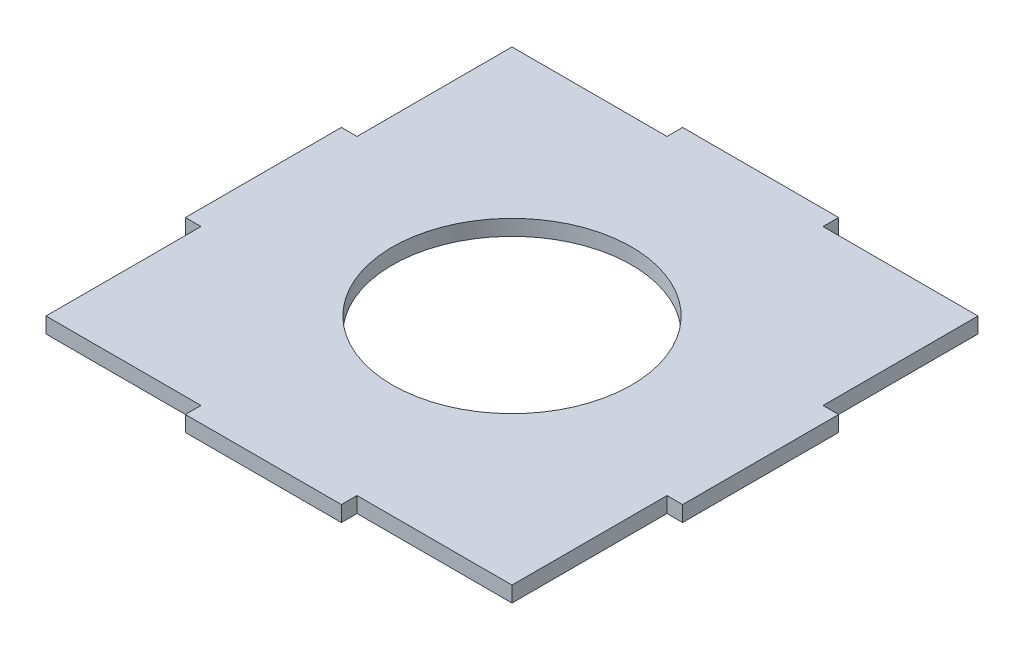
ISO-10303-21;
HEADER;
FILE_DESCRIPTION(('STEP AP214'),'2;1');
FILE_NAME('part.step','',(''),(''),'','','');
FILE_SCHEMA(('AUTOMOTIVE_DESIGN { 1 0 10303 214 1 1 1 1 }'));
ENDSEC;
DATA;
#1=APPLICATION_CONTEXT('core data for automotive mechanical design processes');
#2=APPLICATION_PROTOCOL_DEFINITION('international standard','automotive_design',2000,#1);
#3=PRODUCT_CONTEXT('',#1,'mechanical');
#4=PRODUCT('Part','Part','',(#3));
#5=PRODUCT_RELATED_PRODUCT_CATEGORY('part','',(#4));
#6=PRODUCT_DEFINITION_FORMATION('','',#4);
#7=PRODUCT_DEFINITION_CONTEXT('part definition',#1,'design');
#8=PRODUCT_DEFINITION('design','',#6,#7);
#9=PRODUCT_DEFINITION_SHAPE('','',#8);
#10=(LENGTH_UNIT() NAMED_UNIT(*) SI_UNIT(.MILLI.,.METRE.));
#11=(NAMED_UNIT(*) PLANE_ANGLE_UNIT() SI_UNIT($,.RADIAN.));
#12=(NAMED_UNIT(*) SI_UNIT($,.STERADIAN.) SOLID_ANGLE_UNIT());
#13=UNCERTAINTY_MEASURE_WITH_UNIT(LENGTH_MEASURE(1.E-05),#10,'distance_accuracy_value','');
#14=(GEOMETRIC_REPRESENTATION_CONTEXT(3) GLOBAL_UNCERTAINTY_ASSIGNED_CONTEXT((#13)) GLOBAL_UNIT_ASSIGNED_CONTEXT((#10,
#11,#12)) REPRESENTATION_CONTEXT('',''));
#15=CARTESIAN_POINT('',(0.,0.,0.));
#16=DIRECTION('',(0.,0.,1.));
#17=DIRECTION('',(1.,0.,0.));
#18=AXIS2_PLACEMENT_3D('',#15,#16,#17);
#19=CARTESIAN_POINT('',(-44.8,3.,44.8));
#20=DIRECTION('',(0.,0.,-1.));
#21=DIRECTION('',(-1.,0.,0.));
#22=AXIS2_PLACEMENT_3D('',#19,#20,#21);
#23=PLANE('',#22);
#24=DIRECTION('',(0.,1.,0.));
#25=VECTOR('',#24,1.);
#26=CARTESIAN_POINT('',(14.9999999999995,0.,44.8000000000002));
#27=LINE('',#26,#25);
#28=CARTESIAN_POINT('',(14.9999999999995,0.,44.8000000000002));
#29=VERTEX_POINT('',#28);
#30=CARTESIAN_POINT('',(14.9999999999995,3.,44.8000000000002));
#31=VERTEX_POINT('',#30);
#32=EDGE_CURVE('E244',#29,#31,#27,.T.);
#33=ORIENTED_EDGE('',*,*,#32,.F.);
#34=DIRECTION('',(1.,0.,0.));
#35=VECTOR('',#34,1.);
#36=CARTESIAN_POINT('',(-44.8,0.,44.8));
#37=LINE('',#36,#35);
#38=CARTESIAN_POINT('',(44.8,0.,44.8));
#39=VERTEX_POINT('',#38);
#40=EDGE_CURVE('E194',#29,#39,#37,.T.);
#41=ORIENTED_EDGE('',*,*,#40,.T.);
#42=DIRECTION('',(0.,-1.,0.));
#43=VECTOR('',#42,1.);
#44=CARTESIAN_POINT('',(44.8,3.,44.8));
#45=LINE('',#44,#43);
#46=CARTESIAN_POINT('',(44.8,3.,44.8));
#47=VERTEX_POINT('',#46);
#48=EDGE_CURVE('E41',#47,#39,#45,.T.);
#49=ORIENTED_EDGE('',*,*,#48,.F.);
#50=DIRECTION('',(1.,0.,0.));
#51=VECTOR('',#50,1.);
#52=CARTESIAN_POINT('',(-44.8,3.,44.8));
#53=LINE('',#52,#51);
#54=EDGE_CURVE('E310',#31,#47,#53,.T.);
#55=ORIENTED_EDGE('',*,*,#54,.F.);
#56=EDGE_LOOP('',(#33,#41,#49,#55));
#57=FACE_BOUND('',#56,.T.);
#58=ADVANCED_FACE('F33',(#57),#23,.F.);
#59=CARTESIAN_POINT('',(44.8,3.,-44.8));
#60=DIRECTION('',(-1.,0.,0.));
#61=DIRECTION('',(0.,0.,1.));
#62=AXIS2_PLACEMENT_3D('',#59,#60,#61);
#63=PLANE('',#62);
#64=DIRECTION('',(0.,1.,0.));
#65=VECTOR('',#64,1.);
#66=CARTESIAN_POINT('',(44.8,0.,-15.));
#67=LINE('',#66,#65);
#68=CARTESIAN_POINT('',(44.8,0.,-15.));
#69=VERTEX_POINT('',#68);
#70=CARTESIAN_POINT('',(44.8,3.,-15.));
#71=VERTEX_POINT('',#70);
#72=EDGE_CURVE('E247',#69,#71,#67,.T.);
#73=ORIENTED_EDGE('',*,*,#72,.F.);
#74=DIRECTION('',(0.,0.,-1.));
#75=VECTOR('',#74,1.);
#76=CARTESIAN_POINT('',(44.8,0.,-44.8));
#77=LINE('',#76,#75);
#78=CARTESIAN_POINT('',(44.8,0.,-44.8));
#79=VERTEX_POINT('',#78);
#80=EDGE_CURVE('E193',#69,#79,#77,.T.);
#81=ORIENTED_EDGE('',*,*,#80,.T.);
#82=DIRECTION('',(0.,-1.,0.));
#83=VECTOR('',#82,1.);
#84=CARTESIAN_POINT('',(44.8,3.,-44.8));
#85=LINE('',#84,#83);
#86=CARTESIAN_POINT('',(44.8,3.,-44.8));
#87=VERTEX_POINT('',#86);
#88=EDGE_CURVE('E211',#87,#79,#85,.T.);
#89=ORIENTED_EDGE('',*,*,#88,.F.);
#90=DIRECTION('',(0.,0.,-1.));
#91=VECTOR('',#90,1.);
#92=CARTESIAN_POINT('',(44.8,3.,-44.8));
#93=LINE('',#92,#91);
#94=EDGE_CURVE('E313',#71,#87,#93,.T.);
#95=ORIENTED_EDGE('',*,*,#94,.F.);
#96=EDGE_LOOP('',(#73,#81,#89,#95));
#97=FACE_BOUND('',#96,.T.);
#98=ADVANCED_FACE('F367',(#97),#63,.F.);
#99=CARTESIAN_POINT('',(-44.8,3.,-44.8));
#100=DIRECTION('',(0.,0.,1.));
#101=DIRECTION('',(1.,0.,0.));
#102=AXIS2_PLACEMENT_3D('',#99,#100,#101);
#103=PLANE('',#102);
#104=DIRECTION('',(0.,1.,0.));
#105=VECTOR('',#104,1.);
#106=CARTESIAN_POINT('',(-14.9999999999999,0.,-44.8000000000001));
#107=LINE('',#106,#105);
#108=CARTESIAN_POINT('',(-14.9999999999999,0.,-44.8000000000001));
#109=VERTEX_POINT('',#108);
#110=CARTESIAN_POINT('',(-14.9999999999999,3.,-44.8000000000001));
#111=VERTEX_POINT('',#110);
#112=EDGE_CURVE('E272',#109,#111,#107,.T.);
#113=ORIENTED_EDGE('',*,*,#112,.F.);
#114=DIRECTION('',(-1.,0.,0.));
#115=VECTOR('',#114,1.);
#116=CARTESIAN_POINT('',(-44.8,0.,-44.8));
#117=LINE('',#116,#115);
#118=CARTESIAN_POINT('',(-44.8,0.,-44.8));
#119=VERTEX_POINT('',#118);
#120=EDGE_CURVE('E203',#109,#119,#117,.T.);
#121=ORIENTED_EDGE('',*,*,#120,.T.);
#122=DIRECTION('',(0.,-1.,0.));
#123=VECTOR('',#122,1.);
#124=CARTESIAN_POINT('',(-44.8,3.,-44.8));
#125=LINE('',#124,#123);
#126=CARTESIAN_POINT('',(-44.8,3.,-44.8));
#127=VERTEX_POINT('',#126);
#128=EDGE_CURVE('E208',#127,#119,#125,.T.);
#129=ORIENTED_EDGE('',*,*,#128,.F.);
#130=DIRECTION('',(-1.,0.,0.));
#131=VECTOR('',#130,1.);
#132=CARTESIAN_POINT('',(-44.8,3.,-44.8));
#133=LINE('',#132,#131);
#134=EDGE_CURVE('E314',#111,#127,#133,.T.);
#135=ORIENTED_EDGE('',*,*,#134,.F.);
#136=EDGE_LOOP('',(#113,#121,#129,#135));
#137=FACE_BOUND('',#136,.T.);
#138=ADVANCED_FACE('F325',(#137),#103,.F.);
#139=CARTESIAN_POINT('',(-44.8,3.,-44.8));
#140=DIRECTION('',(1.,0.,0.));
#141=DIRECTION('',(0.,0.,-1.));
#142=AXIS2_PLACEMENT_3D('',#139,#140,#141);
#143=PLANE('',#142);
#144=DIRECTION('',(0.,1.,0.));
#145=VECTOR('',#144,1.);
#146=CARTESIAN_POINT('',(-44.8,0.,15.));
#147=LINE('',#146,#145);
#148=CARTESIAN_POINT('',(-44.8,0.,15.));
#149=VERTEX_POINT('',#148);
#150=CARTESIAN_POINT('',(-44.8,3.,15.));
#151=VERTEX_POINT('',#150);
#152=EDGE_CURVE('E298',#149,#151,#147,.T.);
#153=ORIENTED_EDGE('',*,*,#152,.F.);
#154=DIRECTION('',(0.,0.,1.));
#155=VECTOR('',#154,1.);
#156=CARTESIAN_POINT('',(-44.8,0.,-44.8));
#157=LINE('',#156,#155);
#158=CARTESIAN_POINT('',(-44.8,0.,44.8));
#159=VERTEX_POINT('',#158);
#160=EDGE_CURVE('E300',#149,#159,#157,.T.);
#161=ORIENTED_EDGE('',*,*,#160,.T.);
#162=DIRECTION('',(0.,-1.,0.));
#163=VECTOR('',#162,1.);
#164=CARTESIAN_POINT('',(-44.8,3.,44.8));
#165=LINE('',#164,#163);
#166=CARTESIAN_POINT('',(-44.8,3.,44.8));
#167=VERTEX_POINT('',#166);
#168=EDGE_CURVE('E11',#167,#159,#165,.T.);
#169=ORIENTED_EDGE('',*,*,#168,.F.);
#170=DIRECTION('',(0.,0.,1.));
#171=VECTOR('',#170,1.);
#172=CARTESIAN_POINT('',(-44.8,3.,-44.8));
#173=LINE('',#172,#171);
#174=EDGE_CURVE('E207',#151,#167,#173,.T.);
#175=ORIENTED_EDGE('',*,*,#174,.F.);
#176=EDGE_LOOP('',(#153,#161,#169,#175));
#177=FACE_BOUND('',#176,.T.);
#178=ADVANCED_FACE('F343',(#177),#143,.F.);
#179=CARTESIAN_POINT('',(-44.8,0.,-15.));
#180=VERTEX_POINT('',#179);
#181=EDGE_CURVE('E198',#119,#180,#157,.T.);
#182=ORIENTED_EDGE('',*,*,#181,.T.);
#183=DIRECTION('',(0.,1.,0.));
#184=VECTOR('',#183,1.);
#185=CARTESIAN_POINT('',(-44.8,0.,-15.));
#186=LINE('',#185,#184);
#187=CARTESIAN_POINT('',(-44.8,3.,-15.));
#188=VERTEX_POINT('',#187);
#189=EDGE_CURVE('E290',#180,#188,#186,.T.);
#190=ORIENTED_EDGE('',*,*,#189,.T.);
#191=EDGE_CURVE('E307',#127,#188,#173,.T.);
#192=ORIENTED_EDGE('',*,*,#191,.F.);
#193=ORIENTED_EDGE('',*,*,#128,.T.);
#194=EDGE_LOOP('',(#182,#190,#192,#193));
#195=FACE_BOUND('',#194,.T.);
#196=ADVANCED_FACE('F35',(#195),#143,.F.);
#197=CARTESIAN_POINT('',(-15.0000000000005,0.,44.7999999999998));
#198=VERTEX_POINT('',#197);
#199=EDGE_CURVE('E185',#159,#198,#37,.T.);
#200=ORIENTED_EDGE('',*,*,#199,.T.);
#201=DIRECTION('',(0.,1.,0.));
#202=VECTOR('',#201,1.);
#203=CARTESIAN_POINT('',(-15.0000000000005,0.,44.7999999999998));
#204=LINE('',#203,#202);
#205=CARTESIAN_POINT('',(-15.0000000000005,3.,44.8));
#206=VERTEX_POINT('',#205);
#207=EDGE_CURVE('E168',#198,#206,#204,.T.);
#208=ORIENTED_EDGE('',*,*,#207,.T.);
#209=EDGE_CURVE('E311',#167,#206,#53,.T.);
#210=ORIENTED_EDGE('',*,*,#209,.F.);
#211=ORIENTED_EDGE('',*,*,#168,.T.);
#212=EDGE_LOOP('',(#200,#208,#210,#211));
#213=FACE_BOUND('',#212,.T.);
#214=ADVANCED_FACE('F191',(#213),#23,.F.);
#215=CARTESIAN_POINT('',(44.8,0.,15.));
#216=VERTEX_POINT('',#215);
#217=EDGE_CURVE('E196',#39,#216,#77,.T.);
#218=ORIENTED_EDGE('',*,*,#217,.T.);
#219=DIRECTION('',(0.,1.,0.));
#220=VECTOR('',#219,1.);
#221=CARTESIAN_POINT('',(44.8,0.,15.));
#222=LINE('',#221,#220);
#223=CARTESIAN_POINT('',(44.8,3.,15.));
#224=VERTEX_POINT('',#223);
#225=EDGE_CURVE('E242',#216,#224,#222,.T.);
#226=ORIENTED_EDGE('',*,*,#225,.T.);
#227=EDGE_CURVE('E221',#47,#224,#93,.T.);
#228=ORIENTED_EDGE('',*,*,#227,.F.);
#229=ORIENTED_EDGE('',*,*,#48,.T.);
#230=EDGE_LOOP('',(#218,#226,#228,#229));
#231=FACE_BOUND('',#230,.T.);
#232=ADVANCED_FACE('F219',(#231),#63,.F.);
#233=CARTESIAN_POINT('',(15.0000000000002,0.,-44.7999999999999));
#234=VERTEX_POINT('',#233);
#235=EDGE_CURVE('E204',#79,#234,#117,.T.);
#236=ORIENTED_EDGE('',*,*,#235,.T.);
#237=DIRECTION('',(0.,1.,0.));
#238=VECTOR('',#237,1.);
#239=CARTESIAN_POINT('',(15.0000000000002,0.,-44.7999999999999));
#240=LINE('',#239,#238);
#241=CARTESIAN_POINT('',(15.0000000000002,3.,-44.8));
#242=VERTEX_POINT('',#241);
#243=EDGE_CURVE('E264',#234,#242,#240,.T.);
#244=ORIENTED_EDGE('',*,*,#243,.T.);
#245=EDGE_CURVE('E212',#87,#242,#133,.T.);
#246=ORIENTED_EDGE('',*,*,#245,.F.);
#247=ORIENTED_EDGE('',*,*,#88,.T.);
#248=EDGE_LOOP('',(#236,#244,#246,#247));
#249=FACE_BOUND('',#248,.T.);
#250=ADVANCED_FACE('F378',(#249),#103,.F.);
#251=CARTESIAN_POINT('',(0.,3.,0.));
#252=DIRECTION('',(0.,1.,0.));
#253=DIRECTION('',(0.,0.,1.));
#254=AXIS2_PLACEMENT_3D('',#251,#252,#253);
#255=PLANE('',#254);
#256=CARTESIAN_POINT('',(0.,3.,0.));
#257=DIRECTION('',(0.,1.,0.));
#258=DIRECTION('',(0.,0.,1.));
#259=AXIS2_PLACEMENT_3D('',#256,#257,#258);
#260=CIRCLE('',#259,23.);
#261=CARTESIAN_POINT('',(0.,3.,23.));
#262=VERTEX_POINT('',#261);
#263=EDGE_CURVE('E353',#262,#262,#260,.T.);
#264=ORIENTED_EDGE('',*,*,#263,.F.);
#265=EDGE_LOOP('',(#264));
#266=FACE_BOUND('',#265,.T.);
#267=ORIENTED_EDGE('',*,*,#191,.T.);
#268=DIRECTION('',(-1.,0.,0.));
#269=VECTOR('',#268,1.);
#270=CARTESIAN_POINT('',(-44.8,3.,-15.));
#271=LINE('',#270,#269);
#272=CARTESIAN_POINT('',(-47.8,3.,-15.));
#273=VERTEX_POINT('',#272);
#274=EDGE_CURVE('E274',#188,#273,#271,.T.);
#275=ORIENTED_EDGE('',*,*,#274,.T.);
#276=DIRECTION('',(0.,0.,1.));
#277=VECTOR('',#276,1.);
#278=CARTESIAN_POINT('',(-47.8,3.,-15.));
#279=LINE('',#278,#277);
#280=CARTESIAN_POINT('',(-47.8,3.,15.));
#281=VERTEX_POINT('',#280);
#282=EDGE_CURVE('E293',#273,#281,#279,.T.);
#283=ORIENTED_EDGE('',*,*,#282,.T.);
#284=DIRECTION('',(1.,0.,0.));
#285=VECTOR('',#284,1.);
#286=CARTESIAN_POINT('',(-44.8,3.,15.));
#287=LINE('',#286,#285);
#288=EDGE_CURVE('E285',#281,#151,#287,.T.);
#289=ORIENTED_EDGE('',*,*,#288,.T.);
#290=ORIENTED_EDGE('',*,*,#174,.T.);
#291=ORIENTED_EDGE('',*,*,#209,.T.);
#292=DIRECTION('',(0.,0.,1.));
#293=VECTOR('',#292,1.);
#294=CARTESIAN_POINT('',(-15.0000000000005,3.,44.7999999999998));
#295=LINE('',#294,#293);
#296=CARTESIAN_POINT('',(-15.0000000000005,3.,47.7999999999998));
#297=VERTEX_POINT('',#296);
#298=EDGE_CURVE('E48',#206,#297,#295,.T.);
#299=ORIENTED_EDGE('',*,*,#298,.T.);
#300=DIRECTION('',(1.,0.,0.));
#301=VECTOR('',#300,1.);
#302=CARTESIAN_POINT('',(-15.0000000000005,3.,47.7999999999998));
#303=LINE('',#302,#301);
#304=CARTESIAN_POINT('',(14.9999999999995,3.,47.8000000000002));
#305=VERTEX_POINT('',#304);
#306=EDGE_CURVE('E347',#297,#305,#303,.T.);
#307=ORIENTED_EDGE('',*,*,#306,.T.);
#308=DIRECTION('',(0.,0.,-1.));
#309=VECTOR('',#308,1.);
#310=CARTESIAN_POINT('',(14.9999999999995,3.,44.8000000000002));
#311=LINE('',#310,#309);
#312=EDGE_CURVE('E189',#305,#31,#311,.T.);
#313=ORIENTED_EDGE('',*,*,#312,.T.);
#314=ORIENTED_EDGE('',*,*,#54,.T.);
#315=ORIENTED_EDGE('',*,*,#227,.T.);
#316=DIRECTION('',(1.,0.,0.));
#317=VECTOR('',#316,1.);
#318=CARTESIAN_POINT('',(44.8,3.,15.));
#319=LINE('',#318,#317);
#320=CARTESIAN_POINT('',(47.8,3.,15.));
#321=VERTEX_POINT('',#320);
#322=EDGE_CURVE('E56',#224,#321,#319,.T.);
#323=ORIENTED_EDGE('',*,*,#322,.T.);
#324=DIRECTION('',(0.,0.,-1.));
#325=VECTOR('',#324,1.);
#326=CARTESIAN_POINT('',(47.8,3.,15.));
#327=LINE('',#326,#325);
#328=CARTESIAN_POINT('',(47.8,3.,-15.));
#329=VERTEX_POINT('',#328);
#330=EDGE_CURVE('E237',#321,#329,#327,.T.);
#331=ORIENTED_EDGE('',*,*,#330,.T.);
#332=DIRECTION('',(-1.,0.,0.));
#333=VECTOR('',#332,1.);
#334=CARTESIAN_POINT('',(44.8,3.,-15.));
#335=LINE('',#334,#333);
#336=EDGE_CURVE('E232',#329,#71,#335,.T.);
#337=ORIENTED_EDGE('',*,*,#336,.T.);
#338=ORIENTED_EDGE('',*,*,#94,.T.);
#339=ORIENTED_EDGE('',*,*,#245,.T.);
#340=DIRECTION('',(0.,0.,-1.));
#341=VECTOR('',#340,1.);
#342=CARTESIAN_POINT('',(15.0000000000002,3.,-44.7999999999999));
#343=LINE('',#342,#341);
#344=CARTESIAN_POINT('',(15.0000000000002,3.,-47.7999999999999));
#345=VERTEX_POINT('',#344);
#346=EDGE_CURVE('E249',#242,#345,#343,.T.);
#347=ORIENTED_EDGE('',*,*,#346,.T.);
#348=DIRECTION('',(-1.,0.,0.));
#349=VECTOR('',#348,1.);
#350=CARTESIAN_POINT('',(15.0000000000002,3.,-47.7999999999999));
#351=LINE('',#350,#349);
#352=CARTESIAN_POINT('',(-14.9999999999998,3.,-47.8000000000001));
#353=VERTEX_POINT('',#352);
#354=EDGE_CURVE('E267',#345,#353,#351,.T.);
#355=ORIENTED_EDGE('',*,*,#354,.T.);
#356=DIRECTION('',(0.,0.,1.));
#357=VECTOR('',#356,1.);
#358=CARTESIAN_POINT('',(-14.9999999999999,3.,-44.8000000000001));
#359=LINE('',#358,#357);
#360=EDGE_CURVE('E259',#353,#111,#359,.T.);
#361=ORIENTED_EDGE('',*,*,#360,.T.);
#362=ORIENTED_EDGE('',*,*,#134,.T.);
#363=EDGE_LOOP('',(#267,#275,#283,#289,#290,#291,#299,#307,#313,#314,#315,#323,#331,#337,#338,
#339,#347,#355,#361,#362));
#364=FACE_BOUND('',#363,.T.);
#365=ADVANCED_FACE('F320',(#266,#364),#255,.T.);
#366=CARTESIAN_POINT('',(0.,0.,0.));
#367=DIRECTION('',(0.,1.,0.));
#368=DIRECTION('',(0.,0.,1.));
#369=AXIS2_PLACEMENT_3D('',#366,#367,#368);
#370=PLANE('',#369);
#371=CARTESIAN_POINT('',(0.,0.,0.));
#372=DIRECTION('',(0.,1.,0.));
#373=DIRECTION('',(0.,0.,1.));
#374=AXIS2_PLACEMENT_3D('',#371,#372,#373);
#375=CIRCLE('',#374,23.);
#376=CARTESIAN_POINT('',(0.,0.,23.));
#377=VERTEX_POINT('',#376);
#378=EDGE_CURVE('E349',#377,#377,#375,.T.);
#379=ORIENTED_EDGE('',*,*,#378,.T.);
#380=EDGE_LOOP('',(#379));
#381=FACE_BOUND('',#380,.T.);
#382=ORIENTED_EDGE('',*,*,#181,.F.);
#383=ORIENTED_EDGE('',*,*,#120,.F.);
#384=DIRECTION('',(0.,0.,1.));
#385=VECTOR('',#384,1.);
#386=CARTESIAN_POINT('',(-14.9999999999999,0.,-44.8000000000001));
#387=LINE('',#386,#385);
#388=CARTESIAN_POINT('',(-14.9999999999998,0.,-47.8000000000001));
#389=VERTEX_POINT('',#388);
#390=EDGE_CURVE('E262',#389,#109,#387,.T.);
#391=ORIENTED_EDGE('',*,*,#390,.F.);
#392=DIRECTION('',(-1.,0.,0.));
#393=VECTOR('',#392,1.);
#394=CARTESIAN_POINT('',(15.0000000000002,0.,-47.7999999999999));
#395=LINE('',#394,#393);
#396=CARTESIAN_POINT('',(15.0000000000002,0.,-47.7999999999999));
#397=VERTEX_POINT('',#396);
#398=EDGE_CURVE('E258',#397,#389,#395,.T.);
#399=ORIENTED_EDGE('',*,*,#398,.F.);
#400=DIRECTION('',(0.,0.,-1.));
#401=VECTOR('',#400,1.);
#402=CARTESIAN_POINT('',(15.0000000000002,0.,-44.7999999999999));
#403=LINE('',#402,#401);
#404=EDGE_CURVE('E255',#234,#397,#403,.T.);
#405=ORIENTED_EDGE('',*,*,#404,.F.);
#406=ORIENTED_EDGE('',*,*,#235,.F.);
#407=ORIENTED_EDGE('',*,*,#80,.F.);
#408=DIRECTION('',(-1.,0.,0.));
#409=VECTOR('',#408,1.);
#410=CARTESIAN_POINT('',(44.8,0.,-15.));
#411=LINE('',#410,#409);
#412=CARTESIAN_POINT('',(47.8,0.,-15.));
#413=VERTEX_POINT('',#412);
#414=EDGE_CURVE('E234',#413,#69,#411,.T.);
#415=ORIENTED_EDGE('',*,*,#414,.F.);
#416=DIRECTION('',(0.,0.,-1.));
#417=VECTOR('',#416,1.);
#418=CARTESIAN_POINT('',(47.8,0.,15.));
#419=LINE('',#418,#417);
#420=CARTESIAN_POINT('',(47.8,0.,15.));
#421=VERTEX_POINT('',#420);
#422=EDGE_CURVE('E231',#421,#413,#419,.T.);
#423=ORIENTED_EDGE('',*,*,#422,.F.);
#424=DIRECTION('',(1.,0.,0.));
#425=VECTOR('',#424,1.);
#426=CARTESIAN_POINT('',(44.8,0.,15.));
#427=LINE('',#426,#425);
#428=EDGE_CURVE('E228',#216,#421,#427,.T.);
#429=ORIENTED_EDGE('',*,*,#428,.F.);
#430=ORIENTED_EDGE('',*,*,#217,.F.);
#431=ORIENTED_EDGE('',*,*,#40,.F.);
#432=DIRECTION('',(0.,0.,-1.));
#433=VECTOR('',#432,1.);
#434=CARTESIAN_POINT('',(14.9999999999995,0.,44.8000000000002));
#435=LINE('',#434,#433);
#436=CARTESIAN_POINT('',(14.9999999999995,0.,47.8000000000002));
#437=VERTEX_POINT('',#436);
#438=EDGE_CURVE('E177',#437,#29,#435,.T.);
#439=ORIENTED_EDGE('',*,*,#438,.F.);
#440=DIRECTION('',(1.,0.,0.));
#441=VECTOR('',#440,1.);
#442=CARTESIAN_POINT('',(-15.0000000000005,0.,47.7999999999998));
#443=LINE('',#442,#441);
#444=CARTESIAN_POINT('',(-15.0000000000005,0.,47.7999999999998));
#445=VERTEX_POINT('',#444);
#446=EDGE_CURVE('E188',#445,#437,#443,.T.);
#447=ORIENTED_EDGE('',*,*,#446,.F.);
#448=DIRECTION('',(0.,0.,1.));
#449=VECTOR('',#448,1.);
#450=CARTESIAN_POINT('',(-15.0000000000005,0.,44.7999999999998));
#451=LINE('',#450,#449);
#452=EDGE_CURVE('E171',#198,#445,#451,.T.);
#453=ORIENTED_EDGE('',*,*,#452,.F.);
#454=ORIENTED_EDGE('',*,*,#199,.F.);
#455=ORIENTED_EDGE('',*,*,#160,.F.);
#456=DIRECTION('',(1.,0.,0.));
#457=VECTOR('',#456,1.);
#458=CARTESIAN_POINT('',(-44.8,0.,15.));
#459=LINE('',#458,#457);
#460=CARTESIAN_POINT('',(-47.8,0.,15.));
#461=VERTEX_POINT('',#460);
#462=EDGE_CURVE('E288',#461,#149,#459,.T.);
#463=ORIENTED_EDGE('',*,*,#462,.F.);
#464=DIRECTION('',(0.,0.,1.));
#465=VECTOR('',#464,1.);
#466=CARTESIAN_POINT('',(-47.8,0.,-15.));
#467=LINE('',#466,#465);
#468=CARTESIAN_POINT('',(-47.8,0.,-15.));
#469=VERTEX_POINT('',#468);
#470=EDGE_CURVE('E284',#469,#461,#467,.T.);
#471=ORIENTED_EDGE('',*,*,#470,.F.);
#472=DIRECTION('',(-1.,0.,0.));
#473=VECTOR('',#472,1.);
#474=CARTESIAN_POINT('',(-44.8,0.,-15.));
#475=LINE('',#474,#473);
#476=EDGE_CURVE('E281',#180,#469,#475,.T.);
#477=ORIENTED_EDGE('',*,*,#476,.F.);
#478=EDGE_LOOP('',(#382,#383,#391,#399,#405,#406,#407,#415,#423,#429,#430,#431,#439,#447,#453,
#454,#455,#463,#471,#477));
#479=FACE_BOUND('',#478,.T.);
#480=ADVANCED_FACE('F183',(#381,#479),#370,.F.);
#481=CARTESIAN_POINT('',(-44.8,0.,15.));
#482=DIRECTION('',(0.,0.,1.));
#483=DIRECTION('',(1.,0.,0.));
#484=AXIS2_PLACEMENT_3D('',#481,#482,#483);
#485=PLANE('',#484);
#486=ORIENTED_EDGE('',*,*,#288,.F.);
#487=DIRECTION('',(0.,1.,0.));
#488=VECTOR('',#487,1.);
#489=CARTESIAN_POINT('',(-47.8,0.,15.));
#490=LINE('',#489,#488);
#491=EDGE_CURVE('E301',#461,#281,#490,.T.);
#492=ORIENTED_EDGE('',*,*,#491,.F.);
#493=ORIENTED_EDGE('',*,*,#462,.T.);
#494=ORIENTED_EDGE('',*,*,#152,.T.);
#495=EDGE_LOOP('',(#486,#492,#493,#494));
#496=FACE_BOUND('',#495,.T.);
#497=ADVANCED_FACE('F340',(#496),#485,.T.);
#498=CARTESIAN_POINT('',(-47.8,0.,-15.));
#499=DIRECTION('',(-1.,0.,0.));
#500=DIRECTION('',(0.,0.,1.));
#501=AXIS2_PLACEMENT_3D('',#498,#499,#500);
#502=PLANE('',#501);
#503=ORIENTED_EDGE('',*,*,#282,.F.);
#504=DIRECTION('',(0.,1.,0.));
#505=VECTOR('',#504,1.);
#506=CARTESIAN_POINT('',(-47.8,0.,-15.));
#507=LINE('',#506,#505);
#508=EDGE_CURVE('E303',#469,#273,#507,.T.);
#509=ORIENTED_EDGE('',*,*,#508,.F.);
#510=ORIENTED_EDGE('',*,*,#470,.T.);
#511=ORIENTED_EDGE('',*,*,#491,.T.);
#512=EDGE_LOOP('',(#503,#509,#510,#511));
#513=FACE_BOUND('',#512,.T.);
#514=ADVANCED_FACE('F336',(#513),#502,.T.);
#515=CARTESIAN_POINT('',(-44.8,0.,-15.));
#516=DIRECTION('',(0.,0.,-1.));
#517=DIRECTION('',(-1.,0.,0.));
#518=AXIS2_PLACEMENT_3D('',#515,#516,#517);
#519=PLANE('',#518);
#520=ORIENTED_EDGE('',*,*,#274,.F.);
#521=ORIENTED_EDGE('',*,*,#189,.F.);
#522=ORIENTED_EDGE('',*,*,#476,.T.);
#523=ORIENTED_EDGE('',*,*,#508,.T.);
#524=EDGE_LOOP('',(#520,#521,#522,#523));
#525=FACE_BOUND('',#524,.T.);
#526=ADVANCED_FACE('F331',(#525),#519,.T.);
#527=CARTESIAN_POINT('',(-14.9999999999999,0.,-44.8000000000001));
#528=DIRECTION('',(-1.,0.,0.));
#529=DIRECTION('',(0.,0.,1.));
#530=AXIS2_PLACEMENT_3D('',#527,#528,#529);
#531=PLANE('',#530);
#532=ORIENTED_EDGE('',*,*,#360,.F.);
#533=DIRECTION('',(0.,1.,0.));
#534=VECTOR('',#533,1.);
#535=CARTESIAN_POINT('',(-14.9999999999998,0.,-47.8000000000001));
#536=LINE('',#535,#534);
#537=EDGE_CURVE('E275',#389,#353,#536,.T.);
#538=ORIENTED_EDGE('',*,*,#537,.F.);
#539=ORIENTED_EDGE('',*,*,#390,.T.);
#540=ORIENTED_EDGE('',*,*,#112,.T.);
#541=EDGE_LOOP('',(#532,#538,#539,#540));
#542=FACE_BOUND('',#541,.T.);
#543=ADVANCED_FACE('F407',(#542),#531,.T.);
#544=CARTESIAN_POINT('',(15.0000000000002,0.,-47.7999999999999));
#545=DIRECTION('',(0.,0.,-1.));
#546=DIRECTION('',(-1.,0.,0.));
#547=AXIS2_PLACEMENT_3D('',#544,#545,#546);
#548=PLANE('',#547);
#549=ORIENTED_EDGE('',*,*,#354,.F.);
#550=DIRECTION('',(0.,1.,0.));
#551=VECTOR('',#550,1.);
#552=CARTESIAN_POINT('',(15.0000000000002,0.,-47.7999999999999));
#553=LINE('',#552,#551);
#554=EDGE_CURVE('E277',#397,#345,#553,.T.);
#555=ORIENTED_EDGE('',*,*,#554,.F.);
#556=ORIENTED_EDGE('',*,*,#398,.T.);
#557=ORIENTED_EDGE('',*,*,#537,.T.);
#558=EDGE_LOOP('',(#549,#555,#556,#557));
#559=FACE_BOUND('',#558,.T.);
#560=ADVANCED_FACE('F408',(#559),#548,.T.);
#561=CARTESIAN_POINT('',(15.0000000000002,0.,-44.7999999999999));
#562=DIRECTION('',(1.,0.,0.));
#563=DIRECTION('',(0.,0.,-1.));
#564=AXIS2_PLACEMENT_3D('',#561,#562,#563);
#565=PLANE('',#564);
#566=ORIENTED_EDGE('',*,*,#346,.F.);
#567=ORIENTED_EDGE('',*,*,#243,.F.);
#568=ORIENTED_EDGE('',*,*,#404,.T.);
#569=ORIENTED_EDGE('',*,*,#554,.T.);
#570=EDGE_LOOP('',(#566,#567,#568,#569));
#571=FACE_BOUND('',#570,.T.);
#572=ADVANCED_FACE('F403',(#571),#565,.T.);
#573=CARTESIAN_POINT('',(44.8,0.,-15.));
#574=DIRECTION('',(0.,0.,-1.));
#575=DIRECTION('',(-1.,0.,0.));
#576=AXIS2_PLACEMENT_3D('',#573,#574,#575);
#577=PLANE('',#576);
#578=ORIENTED_EDGE('',*,*,#336,.F.);
#579=DIRECTION('',(0.,1.,0.));
#580=VECTOR('',#579,1.);
#581=CARTESIAN_POINT('',(47.8,0.,-15.));
#582=LINE('',#581,#580);
#583=EDGE_CURVE('E250',#413,#329,#582,.T.);
#584=ORIENTED_EDGE('',*,*,#583,.F.);
#585=ORIENTED_EDGE('',*,*,#414,.T.);
#586=ORIENTED_EDGE('',*,*,#72,.T.);
#587=EDGE_LOOP('',(#578,#584,#585,#586));
#588=FACE_BOUND('',#587,.T.);
#589=ADVANCED_FACE('F415',(#588),#577,.T.);
#590=CARTESIAN_POINT('',(47.8,0.,15.));
#591=DIRECTION('',(1.,0.,0.));
#592=DIRECTION('',(0.,0.,-1.));
#593=AXIS2_PLACEMENT_3D('',#590,#591,#592);
#594=PLANE('',#593);
#595=ORIENTED_EDGE('',*,*,#330,.F.);
#596=DIRECTION('',(0.,1.,0.));
#597=VECTOR('',#596,1.);
#598=CARTESIAN_POINT('',(47.8,0.,15.));
#599=LINE('',#598,#597);
#600=EDGE_CURVE('E252',#421,#321,#599,.T.);
#601=ORIENTED_EDGE('',*,*,#600,.F.);
#602=ORIENTED_EDGE('',*,*,#422,.T.);
#603=ORIENTED_EDGE('',*,*,#583,.T.);
#604=EDGE_LOOP('',(#595,#601,#602,#603));
#605=FACE_BOUND('',#604,.T.);
#606=ADVANCED_FACE('F450',(#605),#594,.T.);
#607=CARTESIAN_POINT('',(44.8,0.,15.));
#608=DIRECTION('',(0.,0.,1.));
#609=DIRECTION('',(1.,0.,0.));
#610=AXIS2_PLACEMENT_3D('',#607,#608,#609);
#611=PLANE('',#610);
#612=ORIENTED_EDGE('',*,*,#322,.F.);
#613=ORIENTED_EDGE('',*,*,#225,.F.);
#614=ORIENTED_EDGE('',*,*,#428,.T.);
#615=ORIENTED_EDGE('',*,*,#600,.T.);
#616=EDGE_LOOP('',(#612,#613,#614,#615));
#617=FACE_BOUND('',#616,.T.);
#618=ADVANCED_FACE('F445',(#617),#611,.T.);
#619=CARTESIAN_POINT('',(14.9999999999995,0.,44.8000000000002));
#620=DIRECTION('',(1.,0.,0.));
#621=DIRECTION('',(0.,0.,-1.));
#622=AXIS2_PLACEMENT_3D('',#619,#620,#621);
#623=PLANE('',#622);
#624=ORIENTED_EDGE('',*,*,#312,.F.);
#625=DIRECTION('',(0.,1.,0.));
#626=VECTOR('',#625,1.);
#627=CARTESIAN_POINT('',(14.9999999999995,0.,47.8000000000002));
#628=LINE('',#627,#626);
#629=EDGE_CURVE('E360',#437,#305,#628,.T.);
#630=ORIENTED_EDGE('',*,*,#629,.F.);
#631=ORIENTED_EDGE('',*,*,#438,.T.);
#632=ORIENTED_EDGE('',*,*,#32,.T.);
#633=EDGE_LOOP('',(#624,#630,#631,#632));
#634=FACE_BOUND('',#633,.T.);
#635=ADVANCED_FACE('F364',(#634),#623,.T.);
#636=CARTESIAN_POINT('',(-15.0000000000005,0.,47.7999999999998));
#637=DIRECTION('',(0.,0.,1.));
#638=DIRECTION('',(1.,0.,0.));
#639=AXIS2_PLACEMENT_3D('',#636,#637,#638);
#640=PLANE('',#639);
#641=ORIENTED_EDGE('',*,*,#306,.F.);
#642=DIRECTION('',(0.,1.,0.));
#643=VECTOR('',#642,1.);
#644=CARTESIAN_POINT('',(-15.0000000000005,0.,47.7999999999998));
#645=LINE('',#644,#643);
#646=EDGE_CURVE('E176',#445,#297,#645,.T.);
#647=ORIENTED_EDGE('',*,*,#646,.F.);
#648=ORIENTED_EDGE('',*,*,#446,.T.);
#649=ORIENTED_EDGE('',*,*,#629,.T.);
#650=EDGE_LOOP('',(#641,#647,#648,#649));
#651=FACE_BOUND('',#650,.T.);
#652=ADVANCED_FACE('F362',(#651),#640,.T.);
#653=CARTESIAN_POINT('',(-15.0000000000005,0.,44.7999999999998));
#654=DIRECTION('',(-1.,0.,0.));
#655=DIRECTION('',(0.,0.,1.));
#656=AXIS2_PLACEMENT_3D('',#653,#654,#655);
#657=PLANE('',#656);
#658=ORIENTED_EDGE('',*,*,#298,.F.);
#659=ORIENTED_EDGE('',*,*,#207,.F.);
#660=ORIENTED_EDGE('',*,*,#452,.T.);
#661=ORIENTED_EDGE('',*,*,#646,.T.);
#662=EDGE_LOOP('',(#658,#659,#660,#661));
#663=FACE_BOUND('',#662,.T.);
#664=ADVANCED_FACE('F170',(#663),#657,.T.);
#665=CARTESIAN_POINT('',(0.,0.,0.));
#666=DIRECTION('',(0.,1.,0.));
#667=DIRECTION('',(0.,0.,1.));
#668=AXIS2_PLACEMENT_3D('',#665,#666,#667);
#669=CYLINDRICAL_SURFACE('',#668,23.);
#670=ORIENTED_EDGE('',*,*,#378,.F.);
#671=EDGE_LOOP('',(#670));
#672=FACE_BOUND('',#671,.T.);
#673=ORIENTED_EDGE('',*,*,#263,.T.);
#674=EDGE_LOOP('',(#673));
#675=FACE_BOUND('',#674,.T.);
#676=ADVANCED_FACE('F431',(#672,#675),#669,.F.);
#677=CLOSED_SHELL('',(#58,#98,#138,#178,#196,#214,#232,#250,#365,#480,#497,#514,#526,#543,#560,
#572,#589,#606,#618,#635,#652,#664,#676));
#678=MANIFOLD_SOLID_BREP('B2',#677);
#679=ADVANCED_BREP_SHAPE_REPRESENTATION('',(#18,#678),#14);
#680=SHAPE_DEFINITION_REPRESENTATION(#9,#679);
ENDSEC;
END-ISO-10303-21;
